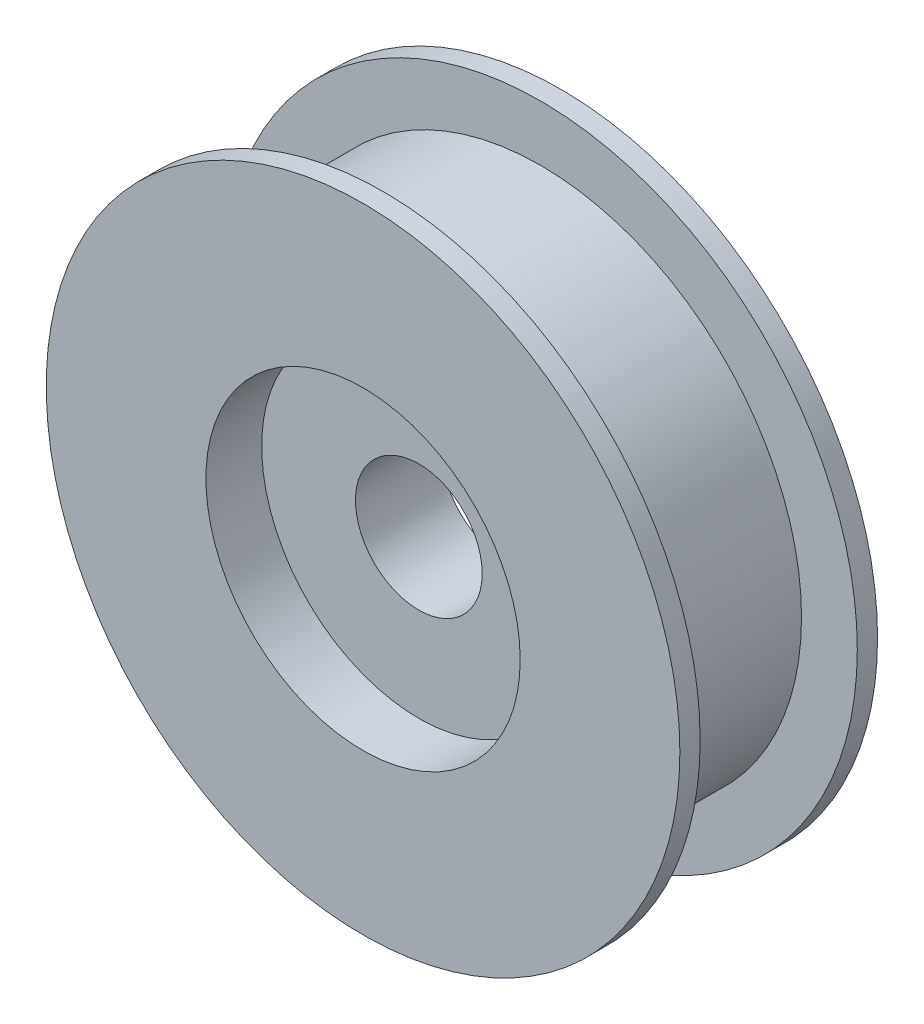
from build123d import *


with BuildPart() as part:
    # Esquisse2 → Base-R_volution (revolve)
    with BuildSketch(Plane(origin=(0, 0, 0), x_dir=(0, 0, -1), z_dir=(1, 0, 0)), mode=Mode.PRIVATE) as base_r_volution_sk:
        Polygon((0, 62.5), (4, 62.5), (4, 51.5), (35, 51.5), (35, 62.5), (39, 62.5), (39, 31), (28, 31), (28, 12.5), (11, 12.5), (11, 31), (0, 31), align=None)
    revolve(base_r_volution_sk.sketch.rotate(Axis((0, 0, 8.085201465), (0, 0, -1)), 90), axis=Axis((0, 0, 8.085201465), (0, 0, -1)))


solid = part.part
